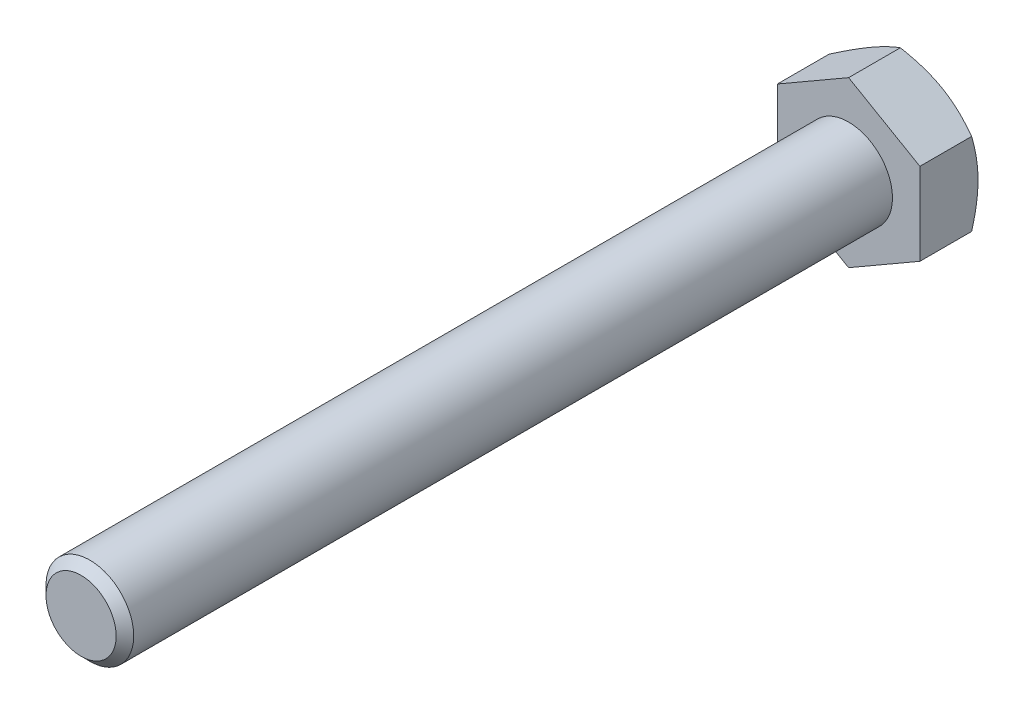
ISO-10303-21;
HEADER;
FILE_DESCRIPTION(('STEP AP214'),'2;1');
FILE_NAME('part.step','',(''),(''),'','','');
FILE_SCHEMA(('AUTOMOTIVE_DESIGN { 1 0 10303 214 1 1 1 1 }'));
ENDSEC;
DATA;
#1=APPLICATION_CONTEXT('core data for automotive mechanical design processes');
#2=APPLICATION_PROTOCOL_DEFINITION('international standard','automotive_design',2000,#1);
#3=PRODUCT_CONTEXT('',#1,'mechanical');
#4=PRODUCT('Part','Part','',(#3));
#5=PRODUCT_RELATED_PRODUCT_CATEGORY('part','',(#4));
#6=PRODUCT_DEFINITION_FORMATION('','',#4);
#7=PRODUCT_DEFINITION_CONTEXT('part definition',#1,'design');
#8=PRODUCT_DEFINITION('design','',#6,#7);
#9=PRODUCT_DEFINITION_SHAPE('','',#8);
#10=(LENGTH_UNIT() NAMED_UNIT(*) SI_UNIT(.MILLI.,.METRE.));
#11=(NAMED_UNIT(*) PLANE_ANGLE_UNIT() SI_UNIT($,.RADIAN.));
#12=(NAMED_UNIT(*) SI_UNIT($,.STERADIAN.) SOLID_ANGLE_UNIT());
#13=UNCERTAINTY_MEASURE_WITH_UNIT(LENGTH_MEASURE(1.E-05),#10,'distance_accuracy_value','');
#14=(GEOMETRIC_REPRESENTATION_CONTEXT(3) GLOBAL_UNCERTAINTY_ASSIGNED_CONTEXT((#13)) GLOBAL_UNIT_ASSIGNED_CONTEXT((#10,
#11,#12)) REPRESENTATION_CONTEXT('',''));
#15=CARTESIAN_POINT('',(0.,0.,0.));
#16=DIRECTION('',(0.,0.,1.));
#17=DIRECTION('',(1.,0.,0.));
#18=AXIS2_PLACEMENT_3D('',#15,#16,#17);
#19=CARTESIAN_POINT('',(0.,0.,70.));
#20=DIRECTION('',(0.,0.,1.));
#21=DIRECTION('',(1.,0.,0.));
#22=AXIS2_PLACEMENT_3D('',#19,#20,#21);
#23=PLANE('',#22);
#24=CARTESIAN_POINT('',(0.,0.,70.));
#25=DIRECTION('',(0.,0.,1.));
#26=DIRECTION('',(1.,0.,0.));
#27=AXIS2_PLACEMENT_3D('',#24,#25,#26);
#28=CIRCLE('',#27,3.20000000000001);
#29=CARTESIAN_POINT('',(3.20000000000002,0.,70.));
#30=VERTEX_POINT('',#29);
#31=EDGE_CURVE('E214',#30,#30,#28,.T.);
#32=ORIENTED_EDGE('',*,*,#31,.T.);
#33=EDGE_LOOP('',(#32));
#34=FACE_BOUND('',#33,.T.);
#35=ADVANCED_FACE('F34',(#34),#23,.T.);
#36=CARTESIAN_POINT('',(0.,0.,0.));
#37=DIRECTION('',(0.,0.,1.));
#38=DIRECTION('',(1.,0.,0.));
#39=AXIS2_PLACEMENT_3D('',#36,#37,#38);
#40=CYLINDRICAL_SURFACE('',#39,4.);
#41=CARTESIAN_POINT('',(0.,0.,69.2));
#42=DIRECTION('',(0.,0.,1.));
#43=DIRECTION('',(1.,0.,0.));
#44=AXIS2_PLACEMENT_3D('',#41,#42,#43);
#45=CIRCLE('',#44,4.);
#46=CARTESIAN_POINT('',(4.00000000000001,0.,69.2));
#47=VERTEX_POINT('',#46);
#48=EDGE_CURVE('E216',#47,#47,#45,.F.);
#49=ORIENTED_EDGE('',*,*,#48,.T.);
#50=EDGE_LOOP('',(#49));
#51=FACE_BOUND('',#50,.T.);
#52=CARTESIAN_POINT('',(0.,0.,0.));
#53=DIRECTION('',(0.,0.,1.));
#54=DIRECTION('',(1.,0.,0.));
#55=AXIS2_PLACEMENT_3D('',#52,#53,#54);
#56=CIRCLE('',#55,4.);
#57=CARTESIAN_POINT('',(4.,0.,0.));
#58=VERTEX_POINT('',#57);
#59=EDGE_CURVE('E217',#58,#58,#56,.F.);
#60=ORIENTED_EDGE('',*,*,#59,.F.);
#61=EDGE_LOOP('',(#60));
#62=FACE_BOUND('',#61,.T.);
#63=ADVANCED_FACE('F205',(#51,#62),#40,.T.);
#64=CARTESIAN_POINT('',(0.,0.,70.));
#65=DIRECTION('',(0.,0.,-1.));
#66=DIRECTION('',(-1.,0.,0.));
#67=AXIS2_PLACEMENT_3D('',#64,#65,#66);
#68=CONICAL_SURFACE('',#67,3.20000000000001,0.785398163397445);
#69=ORIENTED_EDGE('',*,*,#48,.F.);
#70=EDGE_LOOP('',(#69));
#71=FACE_BOUND('',#70,.T.);
#72=ORIENTED_EDGE('',*,*,#31,.F.);
#73=EDGE_LOOP('',(#72));
#74=FACE_BOUND('',#73,.T.);
#75=ADVANCED_FACE('F210',(#71,#74),#68,.T.);
#76=CARTESIAN_POINT('',(0.,7.50555349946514,-5.3));
#77=DIRECTION('',(0.499999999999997,0.86602540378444,0.));
#78=DIRECTION('',(-0.86602540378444,0.499999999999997,0.));
#79=AXIS2_PLACEMENT_3D('',#76,#77,#78);
#80=PLANE('',#79);
#81=CARTESIAN_POINT('',(-0.00020000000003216,7.50566896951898,-4.71937674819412));
#82=CARTESIAN_POINT('',(0.142677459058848,7.4231786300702,-4.76699557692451));
#83=CARTESIAN_POINT('',(0.286087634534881,7.34038072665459,-4.81245329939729));
#84=CARTESIAN_POINT('',(0.574072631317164,7.17411251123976,-4.89845131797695));
#85=CARTESIAN_POINT('',(0.718647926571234,7.09064192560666,-4.93898949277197));
#86=CARTESIAN_POINT('',(1.15468865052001,6.8388936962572,-5.05242899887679));
#87=CARTESIAN_POINT('',(1.44787528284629,6.66962231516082,-5.11695219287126));
#88=CARTESIAN_POINT('',(1.88662374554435,6.41631077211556,-5.19261341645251));
#89=CARTESIAN_POINT('',(2.03087463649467,6.33302748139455,-5.21416714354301));
#90=CARTESIAN_POINT('',(2.32002821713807,6.16608458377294,-5.25030968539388));
#91=CARTESIAN_POINT('',(2.46493084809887,6.08242501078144,-5.26489911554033));
#92=CARTESIAN_POINT('',(2.7549877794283,5.91496056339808,-5.28674124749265));
#93=CARTESIAN_POINT('',(2.90014160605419,5.83115596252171,-5.29400227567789));
#94=CARTESIAN_POINT('',(3.19057533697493,5.66347396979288,-5.30103969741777));
#95=CARTESIAN_POINT('',(3.33585523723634,5.57959658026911,-5.30081632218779));
#96=CARTESIAN_POINT('',(3.73387594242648,5.34979921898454,-5.28991654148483));
#97=CARTESIAN_POINT('',(3.98648646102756,5.20395446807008,-5.27161818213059));
#98=CARTESIAN_POINT('',(4.49002967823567,4.91323365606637,-5.21359365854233));
#99=CARTESIAN_POINT('',(4.74096060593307,4.76835861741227,-5.17384766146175));
#100=CARTESIAN_POINT('',(5.24551722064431,4.47705272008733,-5.07449409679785));
#101=CARTESIAN_POINT('',(5.49907924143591,4.33065861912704,-5.01446557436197));
#102=CARTESIAN_POINT('',(6.00242193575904,4.04005357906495,-4.87822500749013));
#103=CARTESIAN_POINT('',(6.25220905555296,3.89583891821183,-4.8020449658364));
#104=CARTESIAN_POINT('',(6.5002,3.75266127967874,-4.71937674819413));
#105=B_SPLINE_CURVE_WITH_KNOTS('',3,(#81,#82,#83,#84,#85,#86,#87,#88,#89,#90,#91,#92,#93,#94,
#95,#96,#97,#98,#99,#100,#101,#102,#103,#104),.UNSPECIFIED.,.F.,.F.,(4,2,2,2,2,2,2,2,2,2,2,4),
(0.,0.515105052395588,1.03043143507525,2.06322554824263,2.56697389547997,3.07067772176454,
3.57380860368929,4.07692394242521,4.95279354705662,5.82947446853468,6.72559912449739,
7.61996451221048),.UNSPECIFIED.);
#106=CARTESIAN_POINT('',(0.,7.50555349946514,-4.71944341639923));
#107=VERTEX_POINT('',#106);
#108=CARTESIAN_POINT('',(3.24999999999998,5.62916512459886,-5.3));
#109=VERTEX_POINT('',#108);
#110=EDGE_CURVE('E250',#107,#109,#105,.T.);
#111=ORIENTED_EDGE('',*,*,#110,.F.);
#112=DIRECTION('',(0.,0.,1.));
#113=VECTOR('',#112,1.);
#114=CARTESIAN_POINT('',(0.,7.50555349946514,-5.3));
#115=LINE('',#114,#113);
#116=CARTESIAN_POINT('',(0.,7.50555349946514,0.));
#117=VERTEX_POINT('',#116);
#118=EDGE_CURVE('E224',#107,#117,#115,.T.);
#119=ORIENTED_EDGE('',*,*,#118,.T.);
#120=DIRECTION('',(-0.86602540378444,0.499999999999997,0.));
#121=VECTOR('',#120,1.);
#122=CARTESIAN_POINT('',(0.,7.50555349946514,0.));
#123=LINE('',#122,#121);
#124=CARTESIAN_POINT('',(6.5,3.75277674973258,0.));
#125=VERTEX_POINT('',#124);
#126=EDGE_CURVE('E248',#125,#117,#123,.T.);
#127=ORIENTED_EDGE('',*,*,#126,.F.);
#128=DIRECTION('',(0.,0.,1.));
#129=VECTOR('',#128,1.);
#130=CARTESIAN_POINT('',(6.5,3.75277674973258,-5.3));
#131=LINE('',#130,#129);
#132=CARTESIAN_POINT('',(6.5,3.75277674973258,-4.71944341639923));
#133=VERTEX_POINT('',#132);
#134=EDGE_CURVE('E221',#133,#125,#131,.T.);
#135=ORIENTED_EDGE('',*,*,#134,.F.);
#136=EDGE_CURVE('E179',#109,#133,#105,.T.);
#137=ORIENTED_EDGE('',*,*,#136,.F.);
#138=EDGE_LOOP('',(#111,#119,#127,#135,#137));
#139=FACE_BOUND('',#138,.T.);
#140=ADVANCED_FACE('F190',(#139),#80,.T.);
#141=CARTESIAN_POINT('',(6.5,-3.75277674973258,-5.3));
#142=DIRECTION('',(1.,0.,0.));
#143=DIRECTION('',(0.,0.,-1.));
#144=AXIS2_PLACEMENT_3D('',#141,#142,#143);
#145=PLANE('',#144);
#146=CARTESIAN_POINT('',(6.5,-10.2428264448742,-2.04883753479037));
#147=CARTESIAN_POINT('',(6.5,-9.95749123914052,-2.18789595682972));
#148=CARTESIAN_POINT('',(6.5,-9.67151814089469,-2.32566707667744));
#149=CARTESIAN_POINT('',(6.5,-9.09795746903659,-2.59791370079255));
#150=CARTESIAN_POINT('',(6.5,-8.81036966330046,-2.73238871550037));
#151=CARTESIAN_POINT('',(6.5,-8.23183597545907,-2.99796413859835));
#152=CARTESIAN_POINT('',(6.5,-7.94088042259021,-3.12904355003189));
#153=CARTESIAN_POINT('',(6.5,-7.35671087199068,-3.38604980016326));
#154=CARTESIAN_POINT('',(6.5,-7.06349697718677,-3.51197687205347));
#155=CARTESIAN_POINT('',(6.5,-6.46434920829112,-3.7614858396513));
#156=CARTESIAN_POINT('',(6.5,-6.15832132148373,-3.88484316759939));
#157=CARTESIAN_POINT('',(6.5,-5.54274557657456,-4.12260875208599));
#158=CARTESIAN_POINT('',(6.5,-5.23319733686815,-4.2370160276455));
#159=CARTESIAN_POINT('',(6.5,-4.61061796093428,-4.45399730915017));
#160=CARTESIAN_POINT('',(6.5,-4.29759477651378,-4.5565939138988));
#161=CARTESIAN_POINT('',(6.5,-3.66705774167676,-4.74676876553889));
#162=CARTESIAN_POINT('',(6.5,-3.34954528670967,-4.83435157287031));
#163=CARTESIAN_POINT('',(6.5,-2.71162315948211,-4.98994277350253));
#164=CARTESIAN_POINT('',(6.5,-2.3912406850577,-5.05806094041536));
#165=CARTESIAN_POINT('',(6.5,-1.74628166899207,-5.17096432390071));
#166=CARTESIAN_POINT('',(6.5,-1.4217055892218,-5.2157520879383));
#167=CARTESIAN_POINT('',(6.5,-0.935153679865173,-5.26247031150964));
#168=CARTESIAN_POINT('',(6.5,-0.774120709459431,-5.27461755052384));
#169=CARTESIAN_POINT('',(6.5,-0.451677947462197,-5.29209027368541));
#170=CARTESIAN_POINT('',(6.5,-0.290268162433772,-5.29741587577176));
#171=CARTESIAN_POINT('',(6.5,0.0326315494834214,-5.30111032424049));
#172=CARTESIAN_POINT('',(6.5,0.194121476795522,-5.29947913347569));
#173=CARTESIAN_POINT('',(6.5,0.516885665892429,-5.28930353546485));
#174=CARTESIAN_POINT('',(6.5,0.678159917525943,-5.2807588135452));
#175=CARTESIAN_POINT('',(6.5,1.06087214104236,-5.2524625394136));
#176=CARTESIAN_POINT('',(6.5,1.28209274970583,-5.22970222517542));
#177=CARTESIAN_POINT('',(6.5,1.72298724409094,-5.17237790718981));
#178=CARTESIAN_POINT('',(6.5,1.94266093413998,-5.13781243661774));
#179=CARTESIAN_POINT('',(6.5,2.59905068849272,-5.01823337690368));
#180=CARTESIAN_POINT('',(6.5,3.03292018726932,-4.91735524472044));
#181=CARTESIAN_POINT('',(6.5,3.68203059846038,-4.74117763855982));
#182=CARTESIAN_POINT('',(6.5,3.90060192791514,-4.67743243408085));
#183=CARTESIAN_POINT('',(6.5,4.33562456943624,-4.54301317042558));
#184=CARTESIAN_POINT('',(6.5,4.55207586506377,-4.47233905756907));
#185=CARTESIAN_POINT('',(6.5,4.98292314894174,-4.3252213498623));
#186=CARTESIAN_POINT('',(6.5,5.19731969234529,-4.24877936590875));
#187=CARTESIAN_POINT('',(6.5,5.62431367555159,-4.09105605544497));
#188=CARTESIAN_POINT('',(6.5,5.8369111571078,-4.00977484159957));
#189=CARTESIAN_POINT('',(6.5,6.41107024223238,-3.78396124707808));
#190=CARTESIAN_POINT('',(6.5,6.77109993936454,-3.63553740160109));
#191=CARTESIAN_POINT('',(6.5,7.48742894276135,-3.32991367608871));
#192=CARTESIAN_POINT('',(6.5,7.8437278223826,-3.17271280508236));
#193=CARTESIAN_POINT('',(6.5,8.55345570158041,-2.85162072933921));
#194=CARTESIAN_POINT('',(6.5,8.90688352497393,-2.68772693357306));
#195=CARTESIAN_POINT('',(6.5,9.61131133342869,-2.35485675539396));
#196=CARTESIAN_POINT('',(6.5,9.96231141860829,-2.18588058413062));
#197=CARTESIAN_POINT('',(6.5,10.6629371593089,-1.84367823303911));
#198=CARTESIAN_POINT('',(6.5,11.0125596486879,-1.67044558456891));
#199=CARTESIAN_POINT('',(6.5,11.7102232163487,-1.32082260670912));
#200=CARTESIAN_POINT('',(6.5,12.058264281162,-1.14443225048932));
#201=CARTESIAN_POINT('',(6.5,12.7529700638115,-0.789156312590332));
#202=CARTESIAN_POINT('',(6.5,13.099635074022,-0.610271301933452));
#203=CARTESIAN_POINT('',(6.5,13.7918918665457,-0.250435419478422));
#204=CARTESIAN_POINT('',(6.5,14.1374836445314,-0.0694845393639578));
#205=CARTESIAN_POINT('',(6.5,15.099399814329,0.437179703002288));
#206=CARTESIAN_POINT('',(6.5,15.7147468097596,0.764748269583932));
#207=CARTESIAN_POINT('',(6.5,16.9433793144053,1.42381233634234));
#208=CARTESIAN_POINT('',(6.5,17.5566646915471,1.7553080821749));
#209=CARTESIAN_POINT('',(6.5,18.7795711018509,2.4200871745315));
#210=CARTESIAN_POINT('',(6.5,19.389197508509,2.75336064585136));
#211=CARTESIAN_POINT('',(6.5,20.6071616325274,3.42213981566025));
#212=CARTESIAN_POINT('',(6.5,21.2154994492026,3.75764533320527));
#213=CARTESIAN_POINT('',(6.5,21.8233856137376,4.09396124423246));
#214=B_SPLINE_CURVE_WITH_KNOTS('',3,(#146,#147,#148,#149,#150,#151,#152,#153,#154,#155,#156,
#157,#158,#159,#160,#161,#162,#163,#164,#165,#166,#167,#168,#169,#170,#171,#172,#173,#174,#175,
#176,#177,#178,#179,#180,#181,#182,#183,#184,#185,#186,#187,#188,#189,#190,#191,#192,#193,#194,
#195,#196,#197,#198,#199,#200,#201,#202,#203,#204,#205,#206,#207,#208,#209,#210,#211,#212,#213),
.UNSPECIFIED.,.F.,.F.,(4,2,2,2,2,2,2,2,2,2,2,2,2,2,2,2,2,2,2,2,2,2,2,2,2,2,2,2,2,2,2,2,2,4),(0.,
0.952261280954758,1.90466315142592,2.8619801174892,3.81925370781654,4.8090096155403,
5.798873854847,6.78681142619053,7.7744483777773,8.75640022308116,9.73824482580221,
10.2225937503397,10.7069343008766,11.1912774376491,11.6756426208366,12.3424346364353,
13.0093095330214,14.3437044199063,15.0266742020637,15.7096492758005,16.3924343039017,
17.0752034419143,18.2433007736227,19.4115302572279,20.580216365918,21.748853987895,
22.9193933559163,24.0899426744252,25.2602283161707,26.4305186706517,28.5218066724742,
30.6132261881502,32.6975528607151,34.7817125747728),.UNSPECIFIED.);
#215=CARTESIAN_POINT('',(6.5,0.,-5.3));
#216=VERTEX_POINT('',#215);
#217=EDGE_CURVE('E177',#133,#216,#214,.F.);
#218=ORIENTED_EDGE('',*,*,#217,.F.);
#219=ORIENTED_EDGE('',*,*,#134,.T.);
#220=DIRECTION('',(0.,1.,0.));
#221=VECTOR('',#220,1.);
#222=CARTESIAN_POINT('',(6.5,-3.75277674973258,0.));
#223=LINE('',#222,#221);
#224=CARTESIAN_POINT('',(6.5,-3.75277674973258,0.));
#225=VERTEX_POINT('',#224);
#226=EDGE_CURVE('E226',#225,#125,#223,.T.);
#227=ORIENTED_EDGE('',*,*,#226,.F.);
#228=DIRECTION('',(0.,0.,1.));
#229=VECTOR('',#228,1.);
#230=CARTESIAN_POINT('',(6.5,-3.75277674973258,-5.3));
#231=LINE('',#230,#229);
#232=CARTESIAN_POINT('',(6.5,-3.75277674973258,-4.71944341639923));
#233=VERTEX_POINT('',#232);
#234=EDGE_CURVE('E232',#233,#225,#231,.T.);
#235=ORIENTED_EDGE('',*,*,#234,.F.);
#236=EDGE_CURVE('E171',#216,#233,#214,.F.);
#237=ORIENTED_EDGE('',*,*,#236,.F.);
#238=EDGE_LOOP('',(#218,#219,#227,#235,#237));
#239=FACE_BOUND('',#238,.T.);
#240=ADVANCED_FACE('F186',(#239),#145,.T.);
#241=CARTESIAN_POINT('',(0.,-7.50555349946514,-5.3));
#242=DIRECTION('',(0.499999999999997,-0.86602540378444,0.));
#243=DIRECTION('',(0.86602540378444,0.499999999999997,0.));
#244=AXIS2_PLACEMENT_3D('',#241,#242,#243);
#245=PLANE('',#244);
#246=CARTESIAN_POINT('',(6.5002,-3.75266127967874,-4.71937674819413));
#247=CARTESIAN_POINT('',(6.35732254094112,-3.83515161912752,-4.76699557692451));
#248=CARTESIAN_POINT('',(6.21391236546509,-3.91794952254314,-4.81245329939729));
#249=CARTESIAN_POINT('',(5.9259273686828,-4.08421773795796,-4.89845131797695));
#250=CARTESIAN_POINT('',(5.78135207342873,-4.16768832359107,-4.93898949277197));
#251=CARTESIAN_POINT('',(5.34531134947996,-4.41943655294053,-5.05242899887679));
#252=CARTESIAN_POINT('',(5.05212471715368,-4.58870793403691,-5.11695219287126));
#253=CARTESIAN_POINT('',(4.61337625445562,-4.84201947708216,-5.19261341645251));
#254=CARTESIAN_POINT('',(4.4691253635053,-4.92530276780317,-5.21416714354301));
#255=CARTESIAN_POINT('',(4.1799717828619,-5.09224566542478,-5.25030968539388));
#256=CARTESIAN_POINT('',(4.0350691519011,-5.17590523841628,-5.26489911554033));
#257=CARTESIAN_POINT('',(3.74501222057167,-5.34336968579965,-5.28674124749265));
#258=CARTESIAN_POINT('',(3.59985839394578,-5.42717428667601,-5.29400227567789));
#259=CARTESIAN_POINT('',(3.30942466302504,-5.59485627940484,-5.30103969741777));
#260=CARTESIAN_POINT('',(3.16414476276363,-5.67873366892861,-5.3008163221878));
#261=CARTESIAN_POINT('',(2.76612405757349,-5.90853103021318,-5.28991654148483));
#262=CARTESIAN_POINT('',(2.51351353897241,-6.05437578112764,-5.27161818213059));
#263=CARTESIAN_POINT('',(2.0099703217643,-6.34509659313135,-5.21359365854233));
#264=CARTESIAN_POINT('',(1.7590393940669,-6.48997163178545,-5.17384766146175));
#265=CARTESIAN_POINT('',(1.25448277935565,-6.78127752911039,-5.07449409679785));
#266=CARTESIAN_POINT('',(1.00092075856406,-6.92767163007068,-5.01446557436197));
#267=CARTESIAN_POINT('',(0.497578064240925,-7.21827667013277,-4.87822500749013));
#268=CARTESIAN_POINT('',(0.247790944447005,-7.36249133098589,-4.8020449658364));
#269=CARTESIAN_POINT('',(-0.000200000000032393,-7.50566896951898,-4.71937674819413));
#270=B_SPLINE_CURVE_WITH_KNOTS('',3,(#246,#247,#248,#249,#250,#251,#252,#253,#254,#255,#256,
#257,#258,#259,#260,#261,#262,#263,#264,#265,#266,#267,#268,#269),.UNSPECIFIED.,.F.,.F.,(4,2,2,
2,2,2,2,2,2,2,2,4),(0.,0.515105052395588,1.03043143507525,2.06322554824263,2.56697389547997,
3.07067772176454,3.57380860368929,4.07692394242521,4.95279354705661,5.82947446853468,
6.72559912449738,7.61996451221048),.UNSPECIFIED.);
#271=CARTESIAN_POINT('',(3.24999999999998,-5.62916512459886,-5.3));
#272=VERTEX_POINT('',#271);
#273=EDGE_CURVE('E178',#233,#272,#270,.T.);
#274=ORIENTED_EDGE('',*,*,#273,.F.);
#275=ORIENTED_EDGE('',*,*,#234,.T.);
#276=DIRECTION('',(0.86602540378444,0.499999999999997,0.));
#277=VECTOR('',#276,1.);
#278=CARTESIAN_POINT('',(0.,-7.50555349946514,0.));
#279=LINE('',#278,#277);
#280=CARTESIAN_POINT('',(0.,-7.50555349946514,0.));
#281=VERTEX_POINT('',#280);
#282=EDGE_CURVE('E237',#281,#225,#279,.T.);
#283=ORIENTED_EDGE('',*,*,#282,.F.);
#284=DIRECTION('',(0.,0.,1.));
#285=VECTOR('',#284,1.);
#286=CARTESIAN_POINT('',(0.,-7.50555349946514,-5.3));
#287=LINE('',#286,#285);
#288=CARTESIAN_POINT('',(0.,-7.50555349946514,-4.71944341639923));
#289=VERTEX_POINT('',#288);
#290=EDGE_CURVE('E230',#289,#281,#287,.T.);
#291=ORIENTED_EDGE('',*,*,#290,.F.);
#292=EDGE_CURVE('E164',#272,#289,#270,.T.);
#293=ORIENTED_EDGE('',*,*,#292,.F.);
#294=EDGE_LOOP('',(#274,#275,#283,#291,#293));
#295=FACE_BOUND('',#294,.T.);
#296=ADVANCED_FACE('F189',(#295),#245,.T.);
#297=CARTESIAN_POINT('',(0.,-7.50555349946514,-5.3));
#298=DIRECTION('',(-0.500000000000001,-0.866025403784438,0.));
#299=DIRECTION('',(0.866025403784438,-0.500000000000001,0.));
#300=AXIS2_PLACEMENT_3D('',#297,#298,#299);
#301=PLANE('',#300);
#302=CARTESIAN_POINT('',(0.000199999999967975,-7.50566896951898,-4.71937674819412));
#303=CARTESIAN_POINT('',(-0.142677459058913,-7.4231786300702,-4.76699557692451));
#304=CARTESIAN_POINT('',(-0.286087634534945,-7.34038072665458,-4.81245329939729));
#305=CARTESIAN_POINT('',(-0.574072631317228,-7.17411251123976,-4.89845131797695));
#306=CARTESIAN_POINT('',(-0.718647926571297,-7.09064192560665,-4.93898949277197));
#307=CARTESIAN_POINT('',(-1.15468865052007,-6.83889369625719,-5.05242899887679));
#308=CARTESIAN_POINT('',(-1.44787528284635,-6.66962231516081,-5.11695219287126));
#309=CARTESIAN_POINT('',(-1.88662374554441,-6.41631077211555,-5.1926134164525));
#310=CARTESIAN_POINT('',(-2.03087463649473,-6.33302748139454,-5.21416714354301));
#311=CARTESIAN_POINT('',(-2.32002821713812,-6.16608458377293,-5.25030968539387));
#312=CARTESIAN_POINT('',(-2.46493084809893,-6.08242501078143,-5.26489911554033));
#313=CARTESIAN_POINT('',(-2.75498777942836,-5.91496056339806,-5.28674124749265));
#314=CARTESIAN_POINT('',(-2.90014160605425,-5.8311559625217,-5.29400227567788));
#315=CARTESIAN_POINT('',(-3.19057533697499,-5.66347396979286,-5.30103969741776));
#316=CARTESIAN_POINT('',(-3.3358552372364,-5.5795965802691,-5.30081632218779));
#317=CARTESIAN_POINT('',(-3.73387594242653,-5.34979921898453,-5.28991654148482));
#318=CARTESIAN_POINT('',(-3.9864864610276,-5.20395446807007,-5.27161818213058));
#319=CARTESIAN_POINT('',(-4.4900296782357,-4.91323365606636,-5.21359365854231));
#320=CARTESIAN_POINT('',(-4.7409606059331,-4.76835861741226,-5.17384766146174));
#321=CARTESIAN_POINT('',(-5.24551722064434,-4.47705272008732,-5.07449409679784));
#322=CARTESIAN_POINT('',(-5.49907924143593,-4.33065861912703,-5.01446557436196));
#323=CARTESIAN_POINT('',(-6.00242193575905,-4.04005357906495,-4.87822500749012));
#324=CARTESIAN_POINT('',(-6.25220905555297,-3.89583891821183,-4.8020449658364));
#325=CARTESIAN_POINT('',(-6.5002,-3.75266127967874,-4.71937674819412));
#326=B_SPLINE_CURVE_WITH_KNOTS('',3,(#302,#303,#304,#305,#306,#307,#308,#309,#310,#311,#312,
#313,#314,#315,#316,#317,#318,#319,#320,#321,#322,#323,#324,#325),.UNSPECIFIED.,.F.,.F.,(4,2,2,
2,2,2,2,2,2,2,2,4),(0.,0.515105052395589,1.03043143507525,2.06322554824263,2.56697389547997,
3.07067772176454,3.57380860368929,4.07692394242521,4.9527935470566,5.82947446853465,
6.72559912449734,7.61996451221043),.UNSPECIFIED.);
#327=CARTESIAN_POINT('',(-3.25000000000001,-5.62916512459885,-5.3));
#328=VERTEX_POINT('',#327);
#329=EDGE_CURVE('E269',#289,#328,#326,.T.);
#330=ORIENTED_EDGE('',*,*,#329,.F.);
#331=ORIENTED_EDGE('',*,*,#290,.T.);
#332=DIRECTION('',(0.866025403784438,-0.500000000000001,0.));
#333=VECTOR('',#332,1.);
#334=CARTESIAN_POINT('',(0.,-7.50555349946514,0.));
#335=LINE('',#334,#333);
#336=CARTESIAN_POINT('',(-6.5,-3.75277674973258,0.));
#337=VERTEX_POINT('',#336);
#338=EDGE_CURVE('E240',#337,#281,#335,.T.);
#339=ORIENTED_EDGE('',*,*,#338,.F.);
#340=DIRECTION('',(0.,0.,1.));
#341=VECTOR('',#340,1.);
#342=CARTESIAN_POINT('',(-6.5,-3.75277674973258,-5.3));
#343=LINE('',#342,#341);
#344=CARTESIAN_POINT('',(-6.5,-3.75277674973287,-4.71944341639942));
#345=VERTEX_POINT('',#344);
#346=EDGE_CURVE('E228',#345,#337,#343,.T.);
#347=ORIENTED_EDGE('',*,*,#346,.F.);
#348=EDGE_CURVE('E110',#328,#345,#326,.T.);
#349=ORIENTED_EDGE('',*,*,#348,.F.);
#350=EDGE_LOOP('',(#330,#331,#339,#347,#349));
#351=FACE_BOUND('',#350,.T.);
#352=ADVANCED_FACE('F194',(#351),#301,.T.);
#353=CARTESIAN_POINT('',(-6.5,-3.75277674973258,-5.3));
#354=DIRECTION('',(-1.,0.,0.));
#355=DIRECTION('',(0.,0.,1.));
#356=AXIS2_PLACEMENT_3D('',#353,#354,#355);
#357=PLANE('',#356);
#358=CARTESIAN_POINT('',(-6.5,-10.2428264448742,-2.04883753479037));
#359=CARTESIAN_POINT('',(-6.5,-9.95749123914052,-2.18789595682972));
#360=CARTESIAN_POINT('',(-6.5,-9.67151814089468,-2.32566707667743));
#361=CARTESIAN_POINT('',(-6.5,-9.09795746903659,-2.59791370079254));
#362=CARTESIAN_POINT('',(-6.5,-8.81036966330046,-2.73238871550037));
#363=CARTESIAN_POINT('',(-6.5,-8.23183597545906,-2.99796413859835));
#364=CARTESIAN_POINT('',(-6.5,-7.94088042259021,-3.12904355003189));
#365=CARTESIAN_POINT('',(-6.5,-7.35671087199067,-3.38604980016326));
#366=CARTESIAN_POINT('',(-6.5,-7.06349697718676,-3.51197687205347));
#367=CARTESIAN_POINT('',(-6.5,-6.46434920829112,-3.7614858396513));
#368=CARTESIAN_POINT('',(-6.5,-6.15832132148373,-3.88484316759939));
#369=CARTESIAN_POINT('',(-6.5,-5.54274557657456,-4.12260875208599));
#370=CARTESIAN_POINT('',(-6.5,-5.23319733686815,-4.2370160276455));
#371=CARTESIAN_POINT('',(-6.5,-4.61061796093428,-4.45399730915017));
#372=CARTESIAN_POINT('',(-6.5,-4.29759477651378,-4.5565939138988));
#373=CARTESIAN_POINT('',(-6.5,-3.66705774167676,-4.74676876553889));
#374=CARTESIAN_POINT('',(-6.5,-3.34954528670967,-4.83435157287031));
#375=CARTESIAN_POINT('',(-6.5,-2.71162315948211,-4.98994277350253));
#376=CARTESIAN_POINT('',(-6.5,-2.3912406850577,-5.05806094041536));
#377=CARTESIAN_POINT('',(-6.5,-1.74628166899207,-5.17096432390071));
#378=CARTESIAN_POINT('',(-6.5,-1.4217055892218,-5.2157520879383));
#379=CARTESIAN_POINT('',(-6.5,-0.935153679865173,-5.26247031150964));
#380=CARTESIAN_POINT('',(-6.5,-0.774120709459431,-5.27461755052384));
#381=CARTESIAN_POINT('',(-6.5,-0.451677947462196,-5.29209027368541));
#382=CARTESIAN_POINT('',(-6.5,-0.290268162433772,-5.29741587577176));
#383=CARTESIAN_POINT('',(-6.5,0.0326315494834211,-5.30111032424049));
#384=CARTESIAN_POINT('',(-6.5,0.194121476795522,-5.29947913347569));
#385=CARTESIAN_POINT('',(-6.5,0.516885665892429,-5.28930353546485));
#386=CARTESIAN_POINT('',(-6.5,0.678159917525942,-5.2807588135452));
#387=CARTESIAN_POINT('',(-6.5,1.06087214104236,-5.2524625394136));
#388=CARTESIAN_POINT('',(-6.5,1.28209274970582,-5.22970222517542));
#389=CARTESIAN_POINT('',(-6.5,1.72298724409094,-5.17237790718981));
#390=CARTESIAN_POINT('',(-6.5,1.94266093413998,-5.13781243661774));
#391=CARTESIAN_POINT('',(-6.5,2.59905068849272,-5.01823337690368));
#392=CARTESIAN_POINT('',(-6.5,3.03292018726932,-4.91735524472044));
#393=CARTESIAN_POINT('',(-6.5,3.68203059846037,-4.74117763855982));
#394=CARTESIAN_POINT('',(-6.5,3.90060192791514,-4.67743243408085));
#395=CARTESIAN_POINT('',(-6.5,4.33562456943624,-4.54301317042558));
#396=CARTESIAN_POINT('',(-6.5,4.55207586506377,-4.47233905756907));
#397=CARTESIAN_POINT('',(-6.5,4.98292314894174,-4.3252213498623));
#398=CARTESIAN_POINT('',(-6.5,5.19731969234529,-4.24877936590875));
#399=CARTESIAN_POINT('',(-6.5,5.6243136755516,-4.09105605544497));
#400=CARTESIAN_POINT('',(-6.5,5.8369111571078,-4.00977484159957));
#401=CARTESIAN_POINT('',(-6.5,6.41107024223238,-3.78396124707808));
#402=CARTESIAN_POINT('',(-6.5,6.77109993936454,-3.63553740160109));
#403=CARTESIAN_POINT('',(-6.5,7.48742894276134,-3.32991367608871));
#404=CARTESIAN_POINT('',(-6.5,7.8437278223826,-3.17271280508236));
#405=CARTESIAN_POINT('',(-6.5,8.55345570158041,-2.85162072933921));
#406=CARTESIAN_POINT('',(-6.5,8.90688352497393,-2.68772693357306));
#407=CARTESIAN_POINT('',(-6.5,9.61131133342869,-2.35485675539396));
#408=CARTESIAN_POINT('',(-6.5,9.96231141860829,-2.18588058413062));
#409=CARTESIAN_POINT('',(-6.5,10.6629371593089,-1.84367823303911));
#410=CARTESIAN_POINT('',(-6.5,11.0125596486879,-1.67044558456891));
#411=CARTESIAN_POINT('',(-6.5,11.7102232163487,-1.32082260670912));
#412=CARTESIAN_POINT('',(-6.5,12.058264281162,-1.14443225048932));
#413=CARTESIAN_POINT('',(-6.5,12.7529700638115,-0.789156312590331));
#414=CARTESIAN_POINT('',(-6.5,13.099635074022,-0.610271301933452));
#415=CARTESIAN_POINT('',(-6.5,13.7918918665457,-0.250435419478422));
#416=CARTESIAN_POINT('',(-6.5,14.1374836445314,-0.0694845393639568));
#417=CARTESIAN_POINT('',(-6.5,15.099399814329,0.437179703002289));
#418=CARTESIAN_POINT('',(-6.5,15.7147468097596,0.764748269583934));
#419=CARTESIAN_POINT('',(-6.5,16.9433793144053,1.42381233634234));
#420=CARTESIAN_POINT('',(-6.5,17.5566646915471,1.7553080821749));
#421=CARTESIAN_POINT('',(-6.5,18.7795711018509,2.4200871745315));
#422=CARTESIAN_POINT('',(-6.5,19.389197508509,2.75336064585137));
#423=CARTESIAN_POINT('',(-6.5,20.6071616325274,3.42213981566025));
#424=CARTESIAN_POINT('',(-6.5,21.2154994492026,3.75764533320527));
#425=CARTESIAN_POINT('',(-6.5,21.8233856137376,4.09396124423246));
#426=B_SPLINE_CURVE_WITH_KNOTS('',3,(#358,#359,#360,#361,#362,#363,#364,#365,#366,#367,#368,
#369,#370,#371,#372,#373,#374,#375,#376,#377,#378,#379,#380,#381,#382,#383,#384,#385,#386,#387,
#388,#389,#390,#391,#392,#393,#394,#395,#396,#397,#398,#399,#400,#401,#402,#403,#404,#405,#406,
#407,#408,#409,#410,#411,#412,#413,#414,#415,#416,#417,#418,#419,#420,#421,#422,#423,#424,#425),
.UNSPECIFIED.,.F.,.F.,(4,2,2,2,2,2,2,2,2,2,2,2,2,2,2,2,2,2,2,2,2,2,2,2,2,2,2,2,2,2,2,2,2,4),(0.,
0.952261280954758,1.90466315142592,2.8619801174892,3.81925370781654,4.8090096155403,
5.798873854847,6.78681142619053,7.77444837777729,8.75640022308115,9.7382448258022,
10.2225937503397,10.7069343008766,11.1912774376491,11.6756426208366,12.3424346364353,
13.0093095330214,14.3437044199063,15.0266742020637,15.7096492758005,16.3924343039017,
17.0752034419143,18.2433007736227,19.4115302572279,20.580216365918,21.748853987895,
22.9193933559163,24.0899426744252,25.2602283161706,26.4305186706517,28.5218066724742,
30.6132261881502,32.6975528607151,34.7817125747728),.UNSPECIFIED.);
#427=CARTESIAN_POINT('',(-6.5,0.,-5.3));
#428=VERTEX_POINT('',#427);
#429=EDGE_CURVE('E105',#345,#428,#426,.T.);
#430=ORIENTED_EDGE('',*,*,#429,.F.);
#431=ORIENTED_EDGE('',*,*,#346,.T.);
#432=DIRECTION('',(0.,-1.,0.));
#433=VECTOR('',#432,1.);
#434=CARTESIAN_POINT('',(-6.5,-3.75277674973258,0.));
#435=LINE('',#434,#433);
#436=CARTESIAN_POINT('',(-6.5,3.75277674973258,0.));
#437=VERTEX_POINT('',#436);
#438=EDGE_CURVE('E243',#437,#337,#435,.T.);
#439=ORIENTED_EDGE('',*,*,#438,.F.);
#440=DIRECTION('',(0.,0.,1.));
#441=VECTOR('',#440,1.);
#442=CARTESIAN_POINT('',(-6.5,3.75277674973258,-5.3));
#443=LINE('',#442,#441);
#444=CARTESIAN_POINT('',(-6.5,3.75277674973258,-4.71944341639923));
#445=VERTEX_POINT('',#444);
#446=EDGE_CURVE('E131',#445,#437,#443,.T.);
#447=ORIENTED_EDGE('',*,*,#446,.F.);
#448=EDGE_CURVE('E114',#428,#445,#426,.T.);
#449=ORIENTED_EDGE('',*,*,#448,.F.);
#450=EDGE_LOOP('',(#430,#431,#439,#447,#449));
#451=FACE_BOUND('',#450,.T.);
#452=ADVANCED_FACE('F129',(#451),#357,.T.);
#453=CARTESIAN_POINT('',(-6.5,3.75277674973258,-5.3));
#454=DIRECTION('',(-0.500000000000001,0.866025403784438,0.));
#455=DIRECTION('',(-0.866025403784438,-0.500000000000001,0.));
#456=AXIS2_PLACEMENT_3D('',#453,#454,#455);
#457=PLANE('',#456);
#458=CARTESIAN_POINT('',(-6.5002,3.75266127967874,-4.71937674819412));
#459=CARTESIAN_POINT('',(-6.35732254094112,3.83515161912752,-4.76699557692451));
#460=CARTESIAN_POINT('',(-6.21391236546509,3.91794952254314,-4.81245329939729));
#461=CARTESIAN_POINT('',(-5.9259273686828,4.08421773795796,-4.89845131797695));
#462=CARTESIAN_POINT('',(-5.78135207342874,4.16768832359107,-4.93898949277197));
#463=CARTESIAN_POINT('',(-5.34531134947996,4.41943655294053,-5.05242899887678));
#464=CARTESIAN_POINT('',(-5.05212471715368,4.58870793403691,-5.11695219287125));
#465=CARTESIAN_POINT('',(-4.61337625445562,4.84201947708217,-5.1926134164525));
#466=CARTESIAN_POINT('',(-4.46912536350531,4.92530276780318,-5.214167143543));
#467=CARTESIAN_POINT('',(-4.17997178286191,5.09224566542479,-5.25030968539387));
#468=CARTESIAN_POINT('',(-4.03506915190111,5.17590523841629,-5.26489911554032));
#469=CARTESIAN_POINT('',(-3.74501222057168,5.34336968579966,-5.28674124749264));
#470=CARTESIAN_POINT('',(-3.59985839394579,5.42717428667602,-5.29400227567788));
#471=CARTESIAN_POINT('',(-3.30942466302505,5.59485627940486,-5.30103969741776));
#472=CARTESIAN_POINT('',(-3.16414476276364,5.67873366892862,-5.30081632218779));
#473=CARTESIAN_POINT('',(-2.7661240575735,5.90853103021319,-5.28991654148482));
#474=CARTESIAN_POINT('',(-2.51351353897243,6.05437578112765,-5.27161818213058));
#475=CARTESIAN_POINT('',(-2.00997032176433,6.34509659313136,-5.21359365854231));
#476=CARTESIAN_POINT('',(-1.75903939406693,6.48997163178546,-5.17384766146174));
#477=CARTESIAN_POINT('',(-1.25448277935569,6.7812775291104,-5.07449409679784));
#478=CARTESIAN_POINT('',(-1.00092075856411,6.92767163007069,-5.01446557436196));
#479=CARTESIAN_POINT('',(-0.497578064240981,7.21827667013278,-4.87822500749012));
#480=CARTESIAN_POINT('',(-0.247790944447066,7.3624913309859,-4.8020449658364));
#481=CARTESIAN_POINT('',(0.000199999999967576,7.50566896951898,-4.71937674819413));
#482=B_SPLINE_CURVE_WITH_KNOTS('',3,(#458,#459,#460,#461,#462,#463,#464,#465,#466,#467,#468,
#469,#470,#471,#472,#473,#474,#475,#476,#477,#478,#479,#480,#481),.UNSPECIFIED.,.F.,.F.,(4,2,2,
2,2,2,2,2,2,2,2,4),(0.,0.515105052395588,1.03043143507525,2.06322554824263,2.56697389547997,
3.07067772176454,3.57380860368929,4.07692394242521,4.9527935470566,5.82947446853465,
6.72559912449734,7.61996451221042),.UNSPECIFIED.);
#483=CARTESIAN_POINT('',(-3.25000000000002,5.62916512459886,-5.3));
#484=VERTEX_POINT('',#483);
#485=EDGE_CURVE('E120',#445,#484,#482,.T.);
#486=ORIENTED_EDGE('',*,*,#485,.F.);
#487=ORIENTED_EDGE('',*,*,#446,.T.);
#488=DIRECTION('',(-0.866025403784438,-0.500000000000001,0.));
#489=VECTOR('',#488,1.);
#490=CARTESIAN_POINT('',(-6.5,3.75277674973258,0.));
#491=LINE('',#490,#489);
#492=EDGE_CURVE('E246',#117,#437,#491,.T.);
#493=ORIENTED_EDGE('',*,*,#492,.F.);
#494=ORIENTED_EDGE('',*,*,#118,.F.);
#495=EDGE_CURVE('E122',#484,#107,#482,.T.);
#496=ORIENTED_EDGE('',*,*,#495,.F.);
#497=EDGE_LOOP('',(#486,#487,#493,#494,#496));
#498=FACE_BOUND('',#497,.T.);
#499=ADVANCED_FACE('F202',(#498),#457,.T.);
#500=CARTESIAN_POINT('',(6.5,3.75277674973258,0.));
#501=DIRECTION('',(0.,0.,1.));
#502=DIRECTION('',(1.,0.,0.));
#503=AXIS2_PLACEMENT_3D('',#500,#501,#502);
#504=PLANE('',#503);
#505=ORIENTED_EDGE('',*,*,#59,.T.);
#506=EDGE_LOOP('',(#505));
#507=FACE_BOUND('',#506,.T.);
#508=ORIENTED_EDGE('',*,*,#126,.T.);
#509=ORIENTED_EDGE('',*,*,#492,.T.);
#510=ORIENTED_EDGE('',*,*,#438,.T.);
#511=ORIENTED_EDGE('',*,*,#338,.T.);
#512=ORIENTED_EDGE('',*,*,#282,.T.);
#513=ORIENTED_EDGE('',*,*,#226,.T.);
#514=EDGE_LOOP('',(#508,#509,#510,#511,#512,#513));
#515=FACE_BOUND('',#514,.T.);
#516=ADVANCED_FACE('F156',(#507,#515),#504,.T.);
#517=CARTESIAN_POINT('',(0.,0.,0.));
#518=DIRECTION('',(0.,0.,1.));
#519=DIRECTION('',(1.,0.,0.));
#520=AXIS2_PLACEMENT_3D('',#517,#518,#519);
#521=CONICAL_SURFACE('',#520,15.679869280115,1.0471975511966);
#522=ORIENTED_EDGE('',*,*,#136,.T.);
#523=ORIENTED_EDGE('',*,*,#217,.T.);
#524=CARTESIAN_POINT('',(0.,0.,-5.3));
#525=DIRECTION('',(0.,0.,1.));
#526=DIRECTION('',(1.,0.,0.));
#527=AXIS2_PLACEMENT_3D('',#524,#525,#526);
#528=CIRCLE('',#527,6.5);
#529=EDGE_CURVE('E37',#109,#216,#528,.F.);
#530=ORIENTED_EDGE('',*,*,#529,.F.);
#531=EDGE_LOOP('',(#522,#523,#530));
#532=FACE_BOUND('',#531,.T.);
#533=ADVANCED_FACE('F259',(#532),#521,.T.);
#534=ORIENTED_EDGE('',*,*,#110,.T.);
#535=EDGE_CURVE('E127',#484,#109,#528,.F.);
#536=ORIENTED_EDGE('',*,*,#535,.F.);
#537=ORIENTED_EDGE('',*,*,#495,.T.);
#538=EDGE_LOOP('',(#534,#536,#537));
#539=FACE_BOUND('',#538,.T.);
#540=ADVANCED_FACE('F155',(#539),#521,.T.);
#541=ORIENTED_EDGE('',*,*,#448,.T.);
#542=ORIENTED_EDGE('',*,*,#485,.T.);
#543=CARTESIAN_POINT('',(0.,0.,-5.3));
#544=DIRECTION('',(0.,0.,-1.));
#545=DIRECTION('',(-1.,0.,0.));
#546=AXIS2_PLACEMENT_3D('',#543,#544,#545);
#547=CIRCLE('',#546,6.5);
#548=EDGE_CURVE('E55',#428,#484,#547,.T.);
#549=ORIENTED_EDGE('',*,*,#548,.F.);
#550=EDGE_LOOP('',(#541,#542,#549));
#551=FACE_BOUND('',#550,.T.);
#552=ADVANCED_FACE('F118',(#551),#521,.T.);
#553=ORIENTED_EDGE('',*,*,#348,.T.);
#554=ORIENTED_EDGE('',*,*,#429,.T.);
#555=EDGE_CURVE('E107',#328,#428,#528,.F.);
#556=ORIENTED_EDGE('',*,*,#555,.F.);
#557=EDGE_LOOP('',(#553,#554,#556));
#558=FACE_BOUND('',#557,.T.);
#559=ADVANCED_FACE('F106',(#558),#521,.T.);
#560=ORIENTED_EDGE('',*,*,#292,.T.);
#561=ORIENTED_EDGE('',*,*,#329,.T.);
#562=EDGE_CURVE('E42',#272,#328,#528,.F.);
#563=ORIENTED_EDGE('',*,*,#562,.F.);
#564=EDGE_LOOP('',(#560,#561,#563));
#565=FACE_BOUND('',#564,.T.);
#566=ADVANCED_FACE('F271',(#565),#521,.T.);
#567=ORIENTED_EDGE('',*,*,#236,.T.);
#568=ORIENTED_EDGE('',*,*,#273,.T.);
#569=EDGE_CURVE('E11',#216,#272,#528,.F.);
#570=ORIENTED_EDGE('',*,*,#569,.F.);
#571=EDGE_LOOP('',(#567,#568,#570));
#572=FACE_BOUND('',#571,.T.);
#573=ADVANCED_FACE('F266',(#572),#521,.T.);
#574=CARTESIAN_POINT('',(6.5,3.75277674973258,-5.3));
#575=DIRECTION('',(0.,0.,1.));
#576=DIRECTION('',(1.,0.,0.));
#577=AXIS2_PLACEMENT_3D('',#574,#575,#576);
#578=PLANE('',#577);
#579=ORIENTED_EDGE('',*,*,#529,.T.);
#580=ORIENTED_EDGE('',*,*,#569,.T.);
#581=ORIENTED_EDGE('',*,*,#562,.T.);
#582=ORIENTED_EDGE('',*,*,#555,.T.);
#583=ORIENTED_EDGE('',*,*,#548,.T.);
#584=ORIENTED_EDGE('',*,*,#535,.T.);
#585=EDGE_LOOP('',(#579,#580,#581,#582,#583,#584));
#586=FACE_BOUND('',#585,.T.);
#587=ADVANCED_FACE('F125',(#586),#578,.F.);
#588=CLOSED_SHELL('',(#35,#63,#75,#140,#240,#296,#352,#452,#499,#516,#533,#540,#552,#559,#566,
#573,#587));
#589=MANIFOLD_SOLID_BREP('B2',#588);
#590=ADVANCED_BREP_SHAPE_REPRESENTATION('',(#18,#589),#14);
#591=SHAPE_DEFINITION_REPRESENTATION(#9,#590);
ENDSEC;
END-ISO-10303-21;
